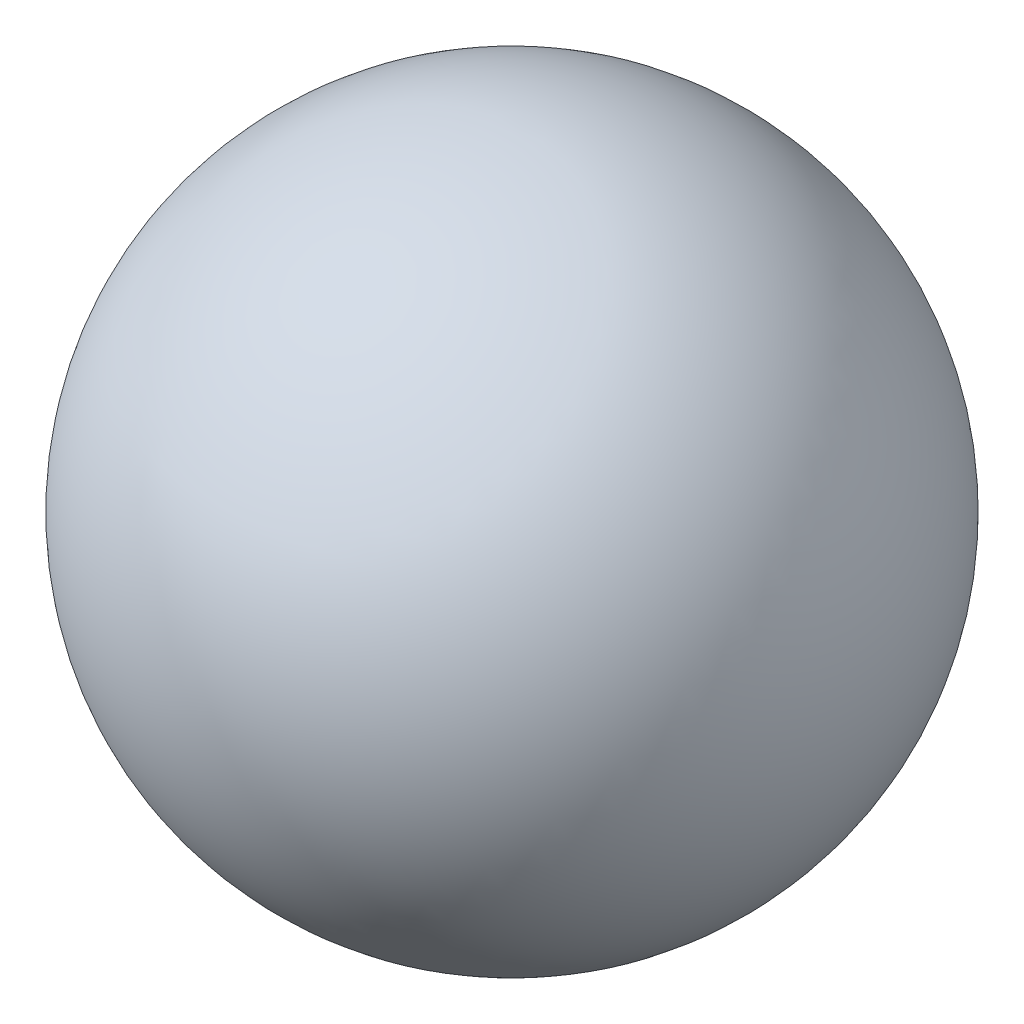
ISO-10303-21;
HEADER;
FILE_DESCRIPTION(('STEP AP214'),'2;1');
FILE_NAME('part.step','',(''),(''),'','','');
FILE_SCHEMA(('AUTOMOTIVE_DESIGN { 1 0 10303 214 1 1 1 1 }'));
ENDSEC;
DATA;
#1=APPLICATION_CONTEXT('core data for automotive mechanical design processes');
#2=APPLICATION_PROTOCOL_DEFINITION('international standard','automotive_design',2000,#1);
#3=PRODUCT_CONTEXT('',#1,'mechanical');
#4=PRODUCT('Part','Part','',(#3));
#5=PRODUCT_RELATED_PRODUCT_CATEGORY('part','',(#4));
#6=PRODUCT_DEFINITION_FORMATION('','',#4);
#7=PRODUCT_DEFINITION_CONTEXT('part definition',#1,'design');
#8=PRODUCT_DEFINITION('design','',#6,#7);
#9=PRODUCT_DEFINITION_SHAPE('','',#8);
#10=(LENGTH_UNIT() NAMED_UNIT(*) SI_UNIT(.MILLI.,.METRE.));
#11=(NAMED_UNIT(*) PLANE_ANGLE_UNIT() SI_UNIT($,.RADIAN.));
#12=(NAMED_UNIT(*) SI_UNIT($,.STERADIAN.) SOLID_ANGLE_UNIT());
#13=UNCERTAINTY_MEASURE_WITH_UNIT(LENGTH_MEASURE(1.E-05),#10,'distance_accuracy_value','');
#14=(GEOMETRIC_REPRESENTATION_CONTEXT(3) GLOBAL_UNCERTAINTY_ASSIGNED_CONTEXT((#13)) GLOBAL_UNIT_ASSIGNED_CONTEXT((#10,
#11,#12)) REPRESENTATION_CONTEXT('',''));
#15=CARTESIAN_POINT('',(0.,0.,0.));
#16=DIRECTION('',(0.,0.,1.));
#17=DIRECTION('',(1.,0.,0.));
#18=AXIS2_PLACEMENT_3D('',#15,#16,#17);
#19=CARTESIAN_POINT('',(0.,10.7621571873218,-1.77025114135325));
#20=DIRECTION('',(0.,1.,0.));
#21=DIRECTION('',(0.,0.,-1.));
#22=AXIS2_PLACEMENT_3D('',#19,#20,#21);
#23=SPHERICAL_SURFACE('',#22,1.19875114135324);
#24=CARTESIAN_POINT('',(0.,10.7621571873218,-0.571500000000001));
#25=VERTEX_POINT('',#24);
#26=VERTEX_LOOP('',#25);
#27=FACE_BOUND('',#26,.T.);
#28=ADVANCED_FACE('F34',(#27),#23,.T.);
#29=CLOSED_SHELL('',(#28));
#30=MANIFOLD_SOLID_BREP('B2',#29);
#31=ADVANCED_BREP_SHAPE_REPRESENTATION('',(#18,#30),#14);
#32=SHAPE_DEFINITION_REPRESENTATION(#9,#31);
ENDSEC;
END-ISO-10303-21;
